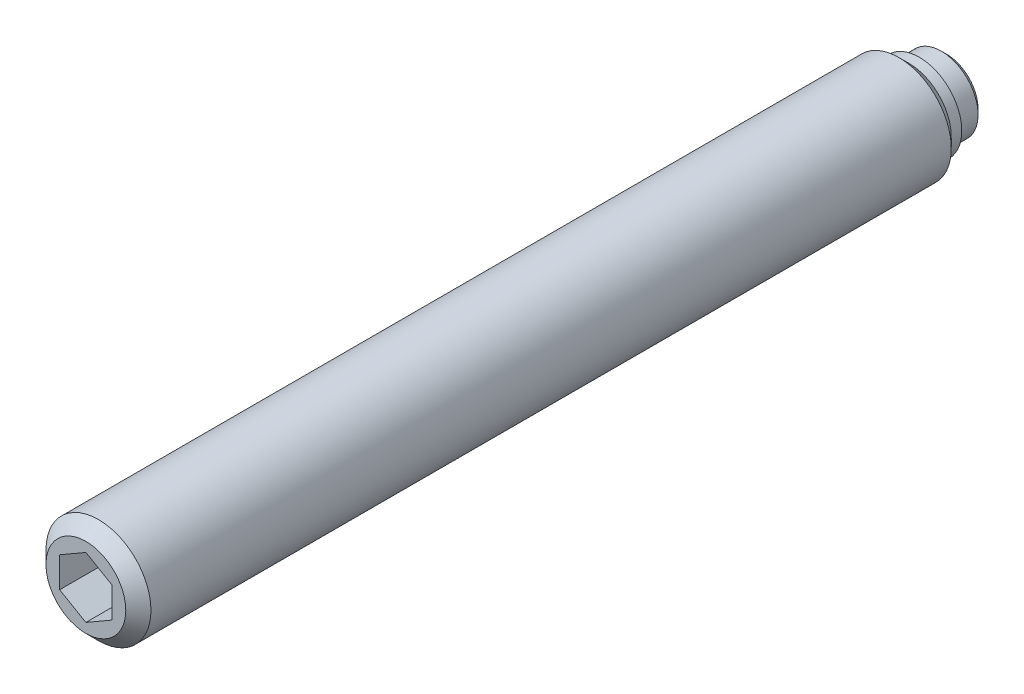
ISO-10303-21;
HEADER;
FILE_DESCRIPTION(('STEP AP214'),'2;1');
FILE_NAME('part.step','',(''),(''),'','','');
FILE_SCHEMA(('AUTOMOTIVE_DESIGN { 1 0 10303 214 1 1 1 1 }'));
ENDSEC;
DATA;
#1=APPLICATION_CONTEXT('core data for automotive mechanical design processes');
#2=APPLICATION_PROTOCOL_DEFINITION('international standard','automotive_design',2000,#1);
#3=PRODUCT_CONTEXT('',#1,'mechanical');
#4=PRODUCT('Part','Part','',(#3));
#5=PRODUCT_RELATED_PRODUCT_CATEGORY('part','',(#4));
#6=PRODUCT_DEFINITION_FORMATION('','',#4);
#7=PRODUCT_DEFINITION_CONTEXT('part definition',#1,'design');
#8=PRODUCT_DEFINITION('design','',#6,#7);
#9=PRODUCT_DEFINITION_SHAPE('','',#8);
#10=(LENGTH_UNIT() NAMED_UNIT(*) SI_UNIT(.MILLI.,.METRE.));
#11=(NAMED_UNIT(*) PLANE_ANGLE_UNIT() SI_UNIT($,.RADIAN.));
#12=(NAMED_UNIT(*) SI_UNIT($,.STERADIAN.) SOLID_ANGLE_UNIT());
#13=UNCERTAINTY_MEASURE_WITH_UNIT(LENGTH_MEASURE(1.E-05),#10,'distance_accuracy_value','');
#14=(GEOMETRIC_REPRESENTATION_CONTEXT(3) GLOBAL_UNCERTAINTY_ASSIGNED_CONTEXT((#13)) GLOBAL_UNIT_ASSIGNED_CONTEXT((#10,
#11,#12)) REPRESENTATION_CONTEXT('',''));
#15=CARTESIAN_POINT('',(0.,0.,0.));
#16=DIRECTION('',(0.,0.,1.));
#17=DIRECTION('',(1.,0.,0.));
#18=AXIS2_PLACEMENT_3D('',#15,#16,#17);
#19=CARTESIAN_POINT('',(0.,0.,2.6));
#20=DIRECTION('',(0.,0.,-1.));
#21=DIRECTION('',(-1.,0.,0.));
#22=AXIS2_PLACEMENT_3D('',#19,#20,#21);
#23=CYLINDRICAL_SURFACE('',#22,5.);
#24=CARTESIAN_POINT('',(0.,0.,4.55));
#25=DIRECTION('',(0.,0.,-1.));
#26=DIRECTION('',(-1.,0.,0.));
#27=AXIS2_PLACEMENT_3D('',#24,#25,#26);
#28=CIRCLE('',#27,5.);
#29=CARTESIAN_POINT('',(-5.,0.,4.55));
#30=VERTEX_POINT('',#29);
#31=EDGE_CURVE('E9',#30,#30,#28,.T.);
#32=ORIENTED_EDGE('',*,*,#31,.F.);
#33=EDGE_LOOP('',(#32));
#34=FACE_BOUND('',#33,.T.);
#35=CARTESIAN_POINT('',(0.,0.,80.8));
#36=DIRECTION('',(0.,0.,1.));
#37=DIRECTION('',(1.,0.,0.));
#38=AXIS2_PLACEMENT_3D('',#35,#36,#37);
#39=CIRCLE('',#38,5.);
#40=CARTESIAN_POINT('',(5.,0.,80.8));
#41=VERTEX_POINT('',#40);
#42=EDGE_CURVE('E123',#41,#41,#39,.T.);
#43=ORIENTED_EDGE('',*,*,#42,.F.);
#44=EDGE_LOOP('',(#43));
#45=FACE_BOUND('',#44,.T.);
#46=ADVANCED_FACE('F14',(#34,#45),#23,.T.);
#47=CARTESIAN_POINT('',(0.,0.,4.55));
#48=DIRECTION('',(0.,0.,1.));
#49=DIRECTION('',(1.,0.,0.));
#50=AXIS2_PLACEMENT_3D('',#47,#48,#49);
#51=CONICAL_SURFACE('',#50,5.,0.785398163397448);
#52=ORIENTED_EDGE('',*,*,#31,.T.);
#53=EDGE_LOOP('',(#52));
#54=FACE_BOUND('',#53,.T.);
#55=CARTESIAN_POINT('',(0.,0.,3.6));
#56=DIRECTION('',(0.,0.,-1.));
#57=DIRECTION('',(-1.,0.,0.));
#58=AXIS2_PLACEMENT_3D('',#55,#56,#57);
#59=CIRCLE('',#58,4.05);
#60=CARTESIAN_POINT('',(-4.05,0.,3.6));
#61=VERTEX_POINT('',#60);
#62=EDGE_CURVE('E21',#61,#61,#59,.T.);
#63=ORIENTED_EDGE('',*,*,#62,.F.);
#64=EDGE_LOOP('',(#63));
#65=FACE_BOUND('',#64,.T.);
#66=ADVANCED_FACE('F143',(#54,#65),#51,.T.);
#67=CARTESIAN_POINT('',(0.,0.,2.6));
#68=DIRECTION('',(0.,0.,-1.));
#69=DIRECTION('',(-1.,0.,0.));
#70=AXIS2_PLACEMENT_3D('',#67,#68,#69);
#71=CYLINDRICAL_SURFACE('',#70,4.05);
#72=ORIENTED_EDGE('',*,*,#62,.T.);
#73=EDGE_LOOP('',(#72));
#74=FACE_BOUND('',#73,.T.);
#75=CARTESIAN_POINT('',(0.,0.,2.6));
#76=DIRECTION('',(0.,0.,-1.));
#77=DIRECTION('',(-1.,0.,0.));
#78=AXIS2_PLACEMENT_3D('',#75,#76,#77);
#79=CIRCLE('',#78,4.05);
#80=CARTESIAN_POINT('',(-4.05,0.,2.6));
#81=VERTEX_POINT('',#80);
#82=EDGE_CURVE('E135',#81,#81,#79,.T.);
#83=ORIENTED_EDGE('',*,*,#82,.F.);
#84=EDGE_LOOP('',(#83));
#85=FACE_BOUND('',#84,.T.);
#86=ADVANCED_FACE('F140',(#74,#85),#71,.T.);
#87=CARTESIAN_POINT('',(0.,4.05,2.6));
#88=DIRECTION('',(0.,0.,1.));
#89=DIRECTION('',(1.,0.,0.));
#90=AXIS2_PLACEMENT_3D('',#87,#88,#89);
#91=PLANE('',#90);
#92=ORIENTED_EDGE('',*,*,#82,.T.);
#93=EDGE_LOOP('',(#92));
#94=FACE_BOUND('',#93,.T.);
#95=CARTESIAN_POINT('',(0.,0.,2.6));
#96=DIRECTION('',(0.,0.,-1.));
#97=DIRECTION('',(-1.,0.,0.));
#98=AXIS2_PLACEMENT_3D('',#95,#96,#97);
#99=CIRCLE('',#98,3.5);
#100=CARTESIAN_POINT('',(-3.5,0.,2.6));
#101=VERTEX_POINT('',#100);
#102=EDGE_CURVE('E132',#101,#101,#99,.T.);
#103=ORIENTED_EDGE('',*,*,#102,.F.);
#104=EDGE_LOOP('',(#103));
#105=FACE_BOUND('',#104,.T.);
#106=ADVANCED_FACE('F151',(#94,#105),#91,.F.);
#107=CARTESIAN_POINT('',(0.,0.,0.));
#108=DIRECTION('',(0.,0.,-1.));
#109=DIRECTION('',(-1.,0.,0.));
#110=AXIS2_PLACEMENT_3D('',#107,#108,#109);
#111=CYLINDRICAL_SURFACE('',#110,3.5);
#112=CARTESIAN_POINT('',(0.,0.,0.5));
#113=DIRECTION('',(0.,0.,-1.));
#114=DIRECTION('',(-1.,0.,0.));
#115=AXIS2_PLACEMENT_3D('',#112,#113,#114);
#116=CIRCLE('',#115,3.5);
#117=CARTESIAN_POINT('',(-3.5,0.,0.5));
#118=VERTEX_POINT('',#117);
#119=EDGE_CURVE('E129',#118,#118,#116,.T.);
#120=ORIENTED_EDGE('',*,*,#119,.F.);
#121=EDGE_LOOP('',(#120));
#122=FACE_BOUND('',#121,.T.);
#123=ORIENTED_EDGE('',*,*,#102,.T.);
#124=EDGE_LOOP('',(#123));
#125=FACE_BOUND('',#124,.T.);
#126=ADVANCED_FACE('F157',(#122,#125),#111,.T.);
#127=CARTESIAN_POINT('',(0.,0.,0.5));
#128=DIRECTION('',(0.,0.,1.));
#129=DIRECTION('',(1.,0.,0.));
#130=AXIS2_PLACEMENT_3D('',#127,#128,#129);
#131=CONICAL_SURFACE('',#130,3.5,0.785398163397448);
#132=CARTESIAN_POINT('',(0.,0.,0.));
#133=DIRECTION('',(0.,0.,-1.));
#134=DIRECTION('',(-1.,0.,0.));
#135=AXIS2_PLACEMENT_3D('',#132,#133,#134);
#136=CIRCLE('',#135,3.);
#137=CARTESIAN_POINT('',(-3.,0.,0.));
#138=VERTEX_POINT('',#137);
#139=EDGE_CURVE('E126',#138,#138,#136,.T.);
#140=ORIENTED_EDGE('',*,*,#139,.F.);
#141=EDGE_LOOP('',(#140));
#142=FACE_BOUND('',#141,.T.);
#143=ORIENTED_EDGE('',*,*,#119,.T.);
#144=EDGE_LOOP('',(#143));
#145=FACE_BOUND('',#144,.T.);
#146=ADVANCED_FACE('F161',(#142,#145),#131,.T.);
#147=CARTESIAN_POINT('',(0.,3.,0.));
#148=DIRECTION('',(0.,0.,1.));
#149=DIRECTION('',(1.,0.,0.));
#150=AXIS2_PLACEMENT_3D('',#147,#148,#149);
#151=PLANE('',#150);
#152=ORIENTED_EDGE('',*,*,#139,.T.);
#153=EDGE_LOOP('',(#152));
#154=FACE_BOUND('',#153,.T.);
#155=ADVANCED_FACE('F165',(#154),#151,.F.);
#156=CARTESIAN_POINT('',(0.,0.,82.));
#157=DIRECTION('',(0.,0.,-1.));
#158=DIRECTION('',(-1.,0.,0.));
#159=AXIS2_PLACEMENT_3D('',#156,#157,#158);
#160=CONICAL_SURFACE('',#159,3.8,0.785398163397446);
#161=ORIENTED_EDGE('',*,*,#42,.T.);
#162=EDGE_LOOP('',(#161));
#163=FACE_BOUND('',#162,.T.);
#164=CARTESIAN_POINT('',(0.,0.,82.));
#165=DIRECTION('',(0.,0.,1.));
#166=DIRECTION('',(1.,0.,0.));
#167=AXIS2_PLACEMENT_3D('',#164,#165,#166);
#168=CIRCLE('',#167,3.8);
#169=CARTESIAN_POINT('',(3.8,0.,82.));
#170=VERTEX_POINT('',#169);
#171=EDGE_CURVE('E115',#170,#170,#168,.T.);
#172=ORIENTED_EDGE('',*,*,#171,.F.);
#173=EDGE_LOOP('',(#172));
#174=FACE_BOUND('',#173,.T.);
#175=ADVANCED_FACE('F169',(#163,#174),#160,.T.);
#176=CARTESIAN_POINT('',(0.,-3.8,82.));
#177=DIRECTION('',(0.,0.,1.));
#178=DIRECTION('',(1.,0.,0.));
#179=AXIS2_PLACEMENT_3D('',#176,#177,#178);
#180=PLANE('',#179);
#181=DIRECTION('',(0.866025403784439,-0.5,0.));
#182=VECTOR('',#181,1.);
#183=CARTESIAN_POINT('',(-2.5,-1.44337567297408,82.));
#184=LINE('',#183,#182);
#185=CARTESIAN_POINT('',(-2.5,-1.44337567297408,82.));
#186=VERTEX_POINT('',#185);
#187=CARTESIAN_POINT('',(0.,-2.88675134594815,82.));
#188=VERTEX_POINT('',#187);
#189=EDGE_CURVE('E28',#186,#188,#184,.T.);
#190=ORIENTED_EDGE('',*,*,#189,.F.);
#191=DIRECTION('',(0.,-1.,0.));
#192=VECTOR('',#191,1.);
#193=CARTESIAN_POINT('',(-2.5,1.44337567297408,82.));
#194=LINE('',#193,#192);
#195=CARTESIAN_POINT('',(-2.5,1.44337567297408,82.));
#196=VERTEX_POINT('',#195);
#197=EDGE_CURVE('E111',#196,#186,#194,.T.);
#198=ORIENTED_EDGE('',*,*,#197,.F.);
#199=DIRECTION('',(-0.866025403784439,-0.5,0.));
#200=VECTOR('',#199,1.);
#201=CARTESIAN_POINT('',(0.,2.88675134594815,82.));
#202=LINE('',#201,#200);
#203=CARTESIAN_POINT('',(0.,2.88675134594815,82.));
#204=VERTEX_POINT('',#203);
#205=EDGE_CURVE('E109',#204,#196,#202,.T.);
#206=ORIENTED_EDGE('',*,*,#205,.F.);
#207=DIRECTION('',(-0.866025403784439,0.5,0.));
#208=VECTOR('',#207,1.);
#209=CARTESIAN_POINT('',(2.5,1.44337567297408,82.));
#210=LINE('',#209,#208);
#211=CARTESIAN_POINT('',(2.5,1.44337567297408,82.));
#212=VERTEX_POINT('',#211);
#213=EDGE_CURVE('E76',#212,#204,#210,.T.);
#214=ORIENTED_EDGE('',*,*,#213,.F.);
#215=DIRECTION('',(0.,1.,0.));
#216=VECTOR('',#215,1.);
#217=CARTESIAN_POINT('',(2.5,-1.44337567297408,82.));
#218=LINE('',#217,#216);
#219=CARTESIAN_POINT('',(2.5,-1.44337567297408,82.));
#220=VERTEX_POINT('',#219);
#221=EDGE_CURVE('E105',#220,#212,#218,.T.);
#222=ORIENTED_EDGE('',*,*,#221,.F.);
#223=DIRECTION('',(0.866025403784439,0.5,0.));
#224=VECTOR('',#223,1.);
#225=CARTESIAN_POINT('',(0.,-2.88675134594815,82.));
#226=LINE('',#225,#224);
#227=EDGE_CURVE('E102',#188,#220,#226,.T.);
#228=ORIENTED_EDGE('',*,*,#227,.F.);
#229=EDGE_LOOP('',(#190,#198,#206,#214,#222,#228));
#230=FACE_BOUND('',#229,.T.);
#231=ORIENTED_EDGE('',*,*,#171,.T.);
#232=EDGE_LOOP('',(#231));
#233=FACE_BOUND('',#232,.T.);
#234=ADVANCED_FACE('F173',(#230,#233),#180,.T.);
#235=CARTESIAN_POINT('',(-2.5,-1.44337567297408,76.));
#236=DIRECTION('',(-0.5,-0.866025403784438,0.));
#237=DIRECTION('',(0.866025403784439,-0.5,0.));
#238=AXIS2_PLACEMENT_3D('',#235,#236,#237);
#239=PLANE('',#238);
#240=ORIENTED_EDGE('',*,*,#189,.T.);
#241=DIRECTION('',(0.,0.,1.));
#242=VECTOR('',#241,1.);
#243=CARTESIAN_POINT('',(0.,-2.88675134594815,76.));
#244=LINE('',#243,#242);
#245=CARTESIAN_POINT('',(0.,-2.88675134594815,76.));
#246=VERTEX_POINT('',#245);
#247=EDGE_CURVE('E58',#246,#188,#244,.T.);
#248=ORIENTED_EDGE('',*,*,#247,.F.);
#249=DIRECTION('',(0.866025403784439,-0.5,0.));
#250=VECTOR('',#249,1.);
#251=CARTESIAN_POINT('',(-2.5,-1.44337567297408,76.));
#252=LINE('',#251,#250);
#253=CARTESIAN_POINT('',(-2.5,-1.44337567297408,76.));
#254=VERTEX_POINT('',#253);
#255=EDGE_CURVE('E113',#254,#246,#252,.T.);
#256=ORIENTED_EDGE('',*,*,#255,.F.);
#257=DIRECTION('',(0.,0.,1.));
#258=VECTOR('',#257,1.);
#259=CARTESIAN_POINT('',(-2.5,-1.44337567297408,76.));
#260=LINE('',#259,#258);
#261=EDGE_CURVE('E36',#254,#186,#260,.T.);
#262=ORIENTED_EDGE('',*,*,#261,.T.);
#263=EDGE_LOOP('',(#240,#248,#256,#262));
#264=FACE_BOUND('',#263,.T.);
#265=ADVANCED_FACE('F177',(#264),#239,.F.);
#266=CARTESIAN_POINT('',(-2.5,1.44337567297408,76.));
#267=DIRECTION('',(-1.,0.,0.));
#268=DIRECTION('',(0.,0.,1.));
#269=AXIS2_PLACEMENT_3D('',#266,#267,#268);
#270=PLANE('',#269);
#271=ORIENTED_EDGE('',*,*,#197,.T.);
#272=ORIENTED_EDGE('',*,*,#261,.F.);
#273=DIRECTION('',(0.,-1.,0.));
#274=VECTOR('',#273,1.);
#275=CARTESIAN_POINT('',(-2.5,1.44337567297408,76.));
#276=LINE('',#275,#274);
#277=CARTESIAN_POINT('',(-2.5,1.44337567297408,76.));
#278=VERTEX_POINT('',#277);
#279=EDGE_CURVE('E88',#278,#254,#276,.T.);
#280=ORIENTED_EDGE('',*,*,#279,.F.);
#281=DIRECTION('',(0.,0.,1.));
#282=VECTOR('',#281,1.);
#283=CARTESIAN_POINT('',(-2.5,1.44337567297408,76.));
#284=LINE('',#283,#282);
#285=EDGE_CURVE('E80',#278,#196,#284,.T.);
#286=ORIENTED_EDGE('',*,*,#285,.T.);
#287=EDGE_LOOP('',(#271,#272,#280,#286));
#288=FACE_BOUND('',#287,.T.);
#289=ADVANCED_FACE('F181',(#288),#270,.F.);
#290=CARTESIAN_POINT('',(0.,2.88675134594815,76.));
#291=DIRECTION('',(-0.5,0.866025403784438,0.));
#292=DIRECTION('',(-0.866025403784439,-0.5,0.));
#293=AXIS2_PLACEMENT_3D('',#290,#291,#292);
#294=PLANE('',#293);
#295=ORIENTED_EDGE('',*,*,#205,.T.);
#296=ORIENTED_EDGE('',*,*,#285,.F.);
#297=DIRECTION('',(-0.866025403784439,-0.5,0.));
#298=VECTOR('',#297,1.);
#299=CARTESIAN_POINT('',(0.,2.88675134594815,76.));
#300=LINE('',#299,#298);
#301=CARTESIAN_POINT('',(0.,2.88675134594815,76.));
#302=VERTEX_POINT('',#301);
#303=EDGE_CURVE('E84',#302,#278,#300,.T.);
#304=ORIENTED_EDGE('',*,*,#303,.F.);
#305=DIRECTION('',(0.,0.,1.));
#306=VECTOR('',#305,1.);
#307=CARTESIAN_POINT('',(0.,2.88675134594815,76.));
#308=LINE('',#307,#306);
#309=EDGE_CURVE('E69',#302,#204,#308,.T.);
#310=ORIENTED_EDGE('',*,*,#309,.T.);
#311=EDGE_LOOP('',(#295,#296,#304,#310));
#312=FACE_BOUND('',#311,.T.);
#313=ADVANCED_FACE('F85',(#312),#294,.F.);
#314=CARTESIAN_POINT('',(2.5,1.44337567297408,76.));
#315=DIRECTION('',(0.5,0.866025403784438,0.));
#316=DIRECTION('',(-0.866025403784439,0.5,0.));
#317=AXIS2_PLACEMENT_3D('',#314,#315,#316);
#318=PLANE('',#317);
#319=ORIENTED_EDGE('',*,*,#213,.T.);
#320=ORIENTED_EDGE('',*,*,#309,.F.);
#321=DIRECTION('',(-0.866025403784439,0.5,0.));
#322=VECTOR('',#321,1.);
#323=CARTESIAN_POINT('',(2.5,1.44337567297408,76.));
#324=LINE('',#323,#322);
#325=CARTESIAN_POINT('',(2.5,1.44337567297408,76.));
#326=VERTEX_POINT('',#325);
#327=EDGE_CURVE('E73',#326,#302,#324,.T.);
#328=ORIENTED_EDGE('',*,*,#327,.F.);
#329=DIRECTION('',(0.,0.,1.));
#330=VECTOR('',#329,1.);
#331=CARTESIAN_POINT('',(2.5,1.44337567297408,76.));
#332=LINE('',#331,#330);
#333=EDGE_CURVE('E81',#326,#212,#332,.T.);
#334=ORIENTED_EDGE('',*,*,#333,.T.);
#335=EDGE_LOOP('',(#319,#320,#328,#334));
#336=FACE_BOUND('',#335,.T.);
#337=ADVANCED_FACE('F71',(#336),#318,.F.);
#338=CARTESIAN_POINT('',(2.5,-1.44337567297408,76.));
#339=DIRECTION('',(1.,0.,0.));
#340=DIRECTION('',(0.,0.,-1.));
#341=AXIS2_PLACEMENT_3D('',#338,#339,#340);
#342=PLANE('',#341);
#343=ORIENTED_EDGE('',*,*,#221,.T.);
#344=ORIENTED_EDGE('',*,*,#333,.F.);
#345=DIRECTION('',(0.,1.,0.));
#346=VECTOR('',#345,1.);
#347=CARTESIAN_POINT('',(2.5,-1.44337567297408,76.));
#348=LINE('',#347,#346);
#349=CARTESIAN_POINT('',(2.5,-1.44337567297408,76.));
#350=VERTEX_POINT('',#349);
#351=EDGE_CURVE('E94',#350,#326,#348,.T.);
#352=ORIENTED_EDGE('',*,*,#351,.F.);
#353=DIRECTION('',(0.,0.,1.));
#354=VECTOR('',#353,1.);
#355=CARTESIAN_POINT('',(2.5,-1.44337567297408,76.));
#356=LINE('',#355,#354);
#357=EDGE_CURVE('E118',#350,#220,#356,.T.);
#358=ORIENTED_EDGE('',*,*,#357,.T.);
#359=EDGE_LOOP('',(#343,#344,#352,#358));
#360=FACE_BOUND('',#359,.T.);
#361=ADVANCED_FACE('F185',(#360),#342,.F.);
#362=CARTESIAN_POINT('',(0.,-2.88675134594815,76.));
#363=DIRECTION('',(0.5,-0.866025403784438,0.));
#364=DIRECTION('',(0.866025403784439,0.5,0.));
#365=AXIS2_PLACEMENT_3D('',#362,#363,#364);
#366=PLANE('',#365);
#367=ORIENTED_EDGE('',*,*,#227,.T.);
#368=ORIENTED_EDGE('',*,*,#357,.F.);
#369=DIRECTION('',(0.866025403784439,0.5,0.));
#370=VECTOR('',#369,1.);
#371=CARTESIAN_POINT('',(0.,-2.88675134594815,76.));
#372=LINE('',#371,#370);
#373=EDGE_CURVE('E96',#246,#350,#372,.T.);
#374=ORIENTED_EDGE('',*,*,#373,.F.);
#375=ORIENTED_EDGE('',*,*,#247,.T.);
#376=EDGE_LOOP('',(#367,#368,#374,#375));
#377=FACE_BOUND('',#376,.T.);
#378=ADVANCED_FACE('F182',(#377),#366,.F.);
#379=CARTESIAN_POINT('',(0.,0.,76.));
#380=DIRECTION('',(0.,0.,1.));
#381=DIRECTION('',(1.,0.,0.));
#382=AXIS2_PLACEMENT_3D('',#379,#380,#381);
#383=PLANE('',#382);
#384=ORIENTED_EDGE('',*,*,#255,.T.);
#385=ORIENTED_EDGE('',*,*,#373,.T.);
#386=ORIENTED_EDGE('',*,*,#351,.T.);
#387=ORIENTED_EDGE('',*,*,#327,.T.);
#388=ORIENTED_EDGE('',*,*,#303,.T.);
#389=ORIENTED_EDGE('',*,*,#279,.T.);
#390=EDGE_LOOP('',(#384,#385,#386,#387,#388,#389));
#391=FACE_BOUND('',#390,.T.);
#392=ADVANCED_FACE('F91',(#391),#383,.T.);
#393=CLOSED_SHELL('',(#46,#66,#86,#106,#126,#146,#155,#175,#234,#265,#289,#313,#337,#361,#378,#392));
#394=MANIFOLD_SOLID_BREP('B1',#393);
#395=ADVANCED_BREP_SHAPE_REPRESENTATION('',(#18,#394),#14);
#396=SHAPE_DEFINITION_REPRESENTATION(#9,#395);
ENDSEC;
END-ISO-10303-21;
